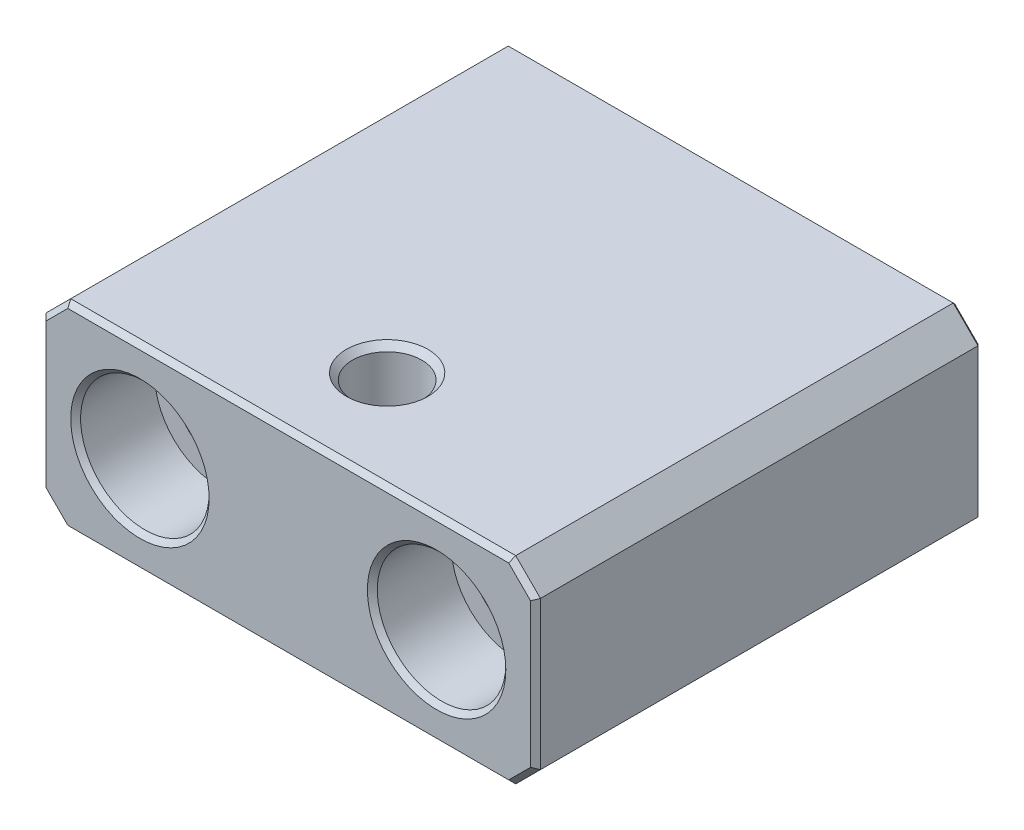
from build123d import *

# Parameters (mm, degrees)
ESQUISSE1_W                                        = 100
ESQUISSE1_H                                        = 40
VOLUME_DEPTH                                       = 90
CHAMBRAGE_POUR_VIS_T_TE_HEXAGONALE_M16_D           = 17.5
CHAMBRAGE_POUR_VIS_T_TE_HEXAGONALE_M16_CBORE_D     = 26
CHAMBRAGE_POUR_VIS_T_TE_HEXAGONALE_M16_CBORE_DEPTH = 16
CHANFREIN3_SIZE                                    = 5
CHANFREIN_1MM_SIZE                                 = 1
CHANFREIN_0_5MM_SIZE                               = 0.5


with BuildPart() as part:
    # Esquisse1 → Volume (new body)
    with BuildSketch(Plane.XY):
        with Locations((0, 20)):
            Rectangle(ESQUISSE1_W, ESQUISSE1_H)
    extrude(amount=VOLUME_DEPTH)

    # Chambrage pour vis _ t_te hexagonale M16 (through all)
    with Locations(Plane(origin=(-30, 20, 90), x_dir=(1, 0, 0), z_dir=(0, 0, 1))):
        with Locations((0, 0), (60, 0)):
            CounterBoreHole(CHAMBRAGE_POUR_VIS_T_TE_HEXAGONALE_M16_D / 2, CHAMBRAGE_POUR_VIS_T_TE_HEXAGONALE_M16_CBORE_D / 2, CHAMBRAGE_POUR_VIS_T_TE_HEXAGONALE_M16_CBORE_DEPTH)

    # Esquisse10 → Trou taraud_ M16 (revolve, cut)
    with BuildSketch(Plane(origin=(0, 0, 70), x_dir=(0, 0, -1), z_dir=(1, 0, 0))):
        Polygon((0, 0), (0, 40), (8.25, 40), (7, 38.75), (7, 1.25), (8.25, 0), align=None)
    revolve(axis=Axis((0, -6.35, 70), (0, 1, 0)), mode=Mode.SUBTRACT)

    # Chanfrein3
    chanfrein3_edges = [part.edges().sort_by_distance(p)[0] for p in [
        (50, 40, 45),
        (50, 0, 45),
        (-50, 0, 45),
        (-50, 40, 45),
    ]]
    chamfer(chanfrein3_edges, length=CHANFREIN3_SIZE)

    # Chanfrein 1mm
    chanfrein_1mm_edges = [part.edges().sort_by_distance(p)[0] for p in [
        (17, 20, 90),
        (-43, 20, 90),
        (0, 40, 90),
        (50, 20, 90),
        (-50, 20, 90),
        (0, 0, 90),
        (-47.5, 2.5, 90),
        (-47.5, 37.5, 90),
        (47.5, 2.5, 90),
        (47.5, 37.5, 90),
    ]]
    chamfer(chanfrein_1mm_edges, length=CHANFREIN_1MM_SIZE)

    # Chanfrein 0.5mm
    chanfrein_0_5mm_edges = [part.edges().sort_by_distance(p)[0] for p in [
        (38.75, 20, 0),
        (-21.25, 20, 0),
        (0, 40, 0),
        (50, 20, 0),
        (0, 0, 0),
        (-50, 20, 0),
        (-47.5, 2.5, 0),
        (-47.5, 37.5, 0),
        (47.5, 2.5, 0),
        (47.5, 37.5, 0),
    ]]
    chamfer(chanfrein_0_5mm_edges, length=CHANFREIN_0_5MM_SIZE)


solid = part.part
